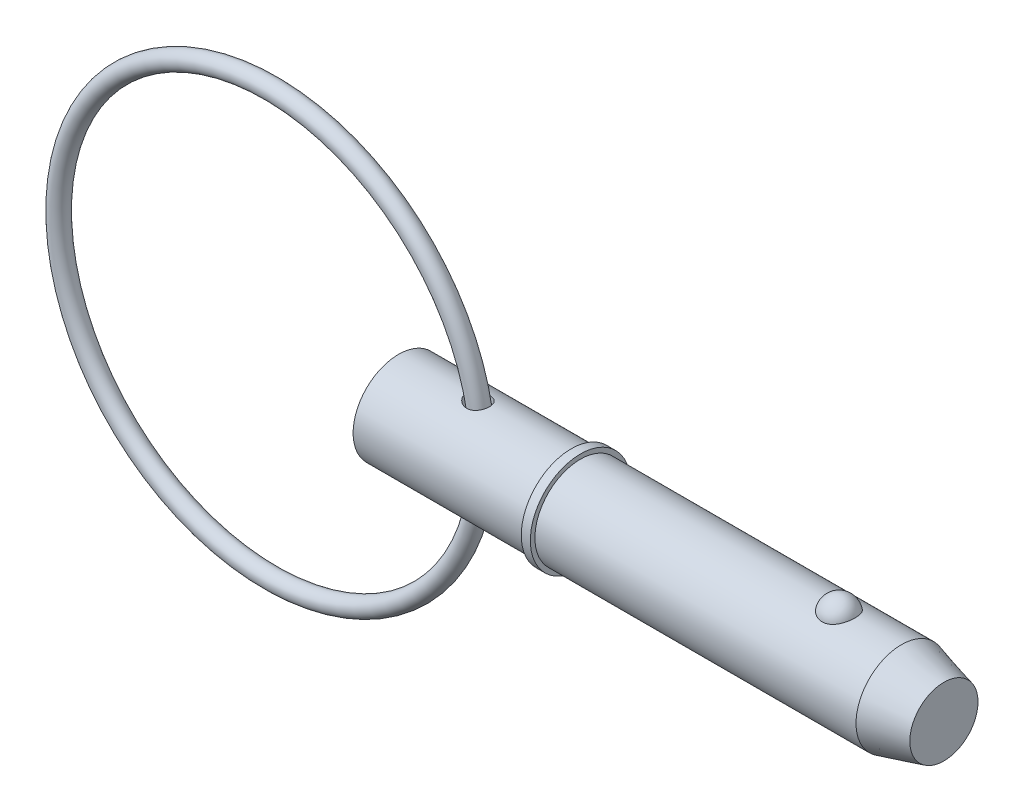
ISO-10303-21;
HEADER;
FILE_DESCRIPTION(('STEP AP214'),'2;1');
FILE_NAME('part.step','',(''),(''),'','','');
FILE_SCHEMA(('AUTOMOTIVE_DESIGN { 1 0 10303 214 1 1 1 1 }'));
ENDSEC;
DATA;
#1=APPLICATION_CONTEXT('core data for automotive mechanical design processes');
#2=APPLICATION_PROTOCOL_DEFINITION('international standard','automotive_design',2000,#1);
#3=PRODUCT_CONTEXT('',#1,'mechanical');
#4=PRODUCT('Part','Part','',(#3));
#5=PRODUCT_RELATED_PRODUCT_CATEGORY('part','',(#4));
#6=PRODUCT_DEFINITION_FORMATION('','',#4);
#7=PRODUCT_DEFINITION_CONTEXT('part definition',#1,'design');
#8=PRODUCT_DEFINITION('design','',#6,#7);
#9=PRODUCT_DEFINITION_SHAPE('','',#8);
#10=(LENGTH_UNIT() NAMED_UNIT(*) SI_UNIT(.MILLI.,.METRE.));
#11=(NAMED_UNIT(*) PLANE_ANGLE_UNIT() SI_UNIT($,.RADIAN.));
#12=(NAMED_UNIT(*) SI_UNIT($,.STERADIAN.) SOLID_ANGLE_UNIT());
#13=UNCERTAINTY_MEASURE_WITH_UNIT(LENGTH_MEASURE(1.E-05),#10,'distance_accuracy_value','');
#14=(GEOMETRIC_REPRESENTATION_CONTEXT(3) GLOBAL_UNCERTAINTY_ASSIGNED_CONTEXT((#13)) GLOBAL_UNIT_ASSIGNED_CONTEXT((#10,
#11,#12)) REPRESENTATION_CONTEXT('',''));
#15=CARTESIAN_POINT('',(0.,0.,0.));
#16=DIRECTION('',(0.,0.,1.));
#17=DIRECTION('',(1.,0.,0.));
#18=AXIS2_PLACEMENT_3D('',#15,#16,#17);
#19=CARTESIAN_POINT('',(-13.4013067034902,0.,0.));
#20=DIRECTION('',(0.,0.,1.));
#21=DIRECTION('',(1.,0.,0.));
#22=AXIS2_PLACEMENT_3D('',#19,#20,#21);
#23=TOROIDAL_SURFACE('',#22,22.225,0.952999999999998);
#24=CARTESIAN_POINT('',(9.77669329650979,0.,0.));
#25=VERTEX_POINT('',#24);
#26=VERTEX_LOOP('',#25);
#27=FACE_BOUND('',#26,.T.);
#28=ADVANCED_FACE('P0_F12',(#27),#23,.T.);
#29=CLOSED_SHELL('',(#28));
#30=MANIFOLD_SOLID_BREP('P0_B1',#29);
#31=CARTESIAN_POINT('',(0.,0.,0.));
#32=DIRECTION('',(1.,0.,0.));
#33=DIRECTION('',(0.,0.,-1.));
#34=AXIS2_PLACEMENT_3D('',#31,#32,#33);
#35=CYLINDRICAL_SURFACE('',#34,4.765);
#36=CARTESIAN_POINT('',(7.31773584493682,4.71580709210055,-0.682926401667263));
#37=CARTESIAN_POINT('',(7.3607471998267,4.70750812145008,-0.740230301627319));
#38=CARTESIAN_POINT('',(7.40883112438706,4.69869300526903,-0.79371122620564));
#39=CARTESIAN_POINT('',(7.51340999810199,4.68106981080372,-0.89180043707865));
#40=CARTESIAN_POINT('',(7.56991882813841,4.67226176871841,-0.936393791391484));
#41=CARTESIAN_POINT('',(7.689548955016,4.65568581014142,-1.01560363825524));
#42=CARTESIAN_POINT('',(7.75265928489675,4.64791621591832,-1.05023633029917));
#43=CARTESIAN_POINT('',(7.88387110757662,4.6343185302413,-1.10870278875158));
#44=CARTESIAN_POINT('',(7.95197058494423,4.62848966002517,-1.13254088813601));
#45=CARTESIAN_POINT('',(8.09209413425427,4.6194749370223,-1.16877415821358));
#46=CARTESIAN_POINT('',(8.16415141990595,4.6163169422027,-1.18104886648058));
#47=CARTESIAN_POINT('',(8.30937958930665,4.61324608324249,-1.19299123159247));
#48=CARTESIAN_POINT('',(8.38255011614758,4.61333220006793,-1.19266284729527));
#49=CARTESIAN_POINT('',(8.52374186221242,4.61674026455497,-1.17939593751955));
#50=CARTESIAN_POINT('',(8.59183022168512,4.61989017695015,-1.16712781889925));
#51=CARTESIAN_POINT('',(8.72470143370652,4.62884731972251,-1.13107903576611));
#52=CARTESIAN_POINT('',(8.78948513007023,4.63465386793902,-1.10730132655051));
#53=CARTESIAN_POINT('',(8.91088768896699,4.64792402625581,-1.05016249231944));
#54=CARTESIAN_POINT('',(8.96774302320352,4.65530108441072,-1.01728198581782));
#55=CARTESIAN_POINT('',(9.07499804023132,4.67102002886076,-0.942471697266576));
#56=CARTESIAN_POINT('',(9.12539777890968,4.6793619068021,-0.900541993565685));
#57=CARTESIAN_POINT('',(9.21836221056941,4.69607497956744,-0.808868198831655));
#58=CARTESIAN_POINT('',(9.26093651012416,4.70444612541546,-0.759133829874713));
#59=CARTESIAN_POINT('',(9.33728390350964,4.72032100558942,-0.653192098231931));
#60=CARTESIAN_POINT('',(9.3710564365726,4.72782468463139,-0.596984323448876));
#61=CARTESIAN_POINT('',(9.42940600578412,4.74126034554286,-0.478808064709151));
#62=CARTESIAN_POINT('',(9.45384681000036,4.74716869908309,-0.416769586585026));
#63=CARTESIAN_POINT('',(9.49226260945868,4.75663465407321,-0.289362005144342));
#64=CARTESIAN_POINT('',(9.50623742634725,4.76019221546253,-0.22399284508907));
#65=CARTESIAN_POINT('',(9.52342004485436,4.76458450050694,-0.0914886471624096));
#66=CARTESIAN_POINT('',(9.52658321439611,4.7654079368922,-0.0243474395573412));
#67=CARTESIAN_POINT('',(9.52194012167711,4.76421136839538,0.109528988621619));
#68=CARTESIAN_POINT('',(9.51413380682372,4.7621913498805,0.176264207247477));
#69=CARTESIAN_POINT('',(9.48775485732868,4.75552896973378,0.307367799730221));
#70=CARTESIAN_POINT('',(9.4691926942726,4.75088915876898,0.371738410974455));
#71=CARTESIAN_POINT('',(9.42175836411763,4.73949008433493,0.496364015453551));
#72=CARTESIAN_POINT('',(9.39288586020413,4.73273075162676,0.556618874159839));
#73=CARTESIAN_POINT('',(9.32549385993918,4.71782154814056,0.671371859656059));
#74=CARTESIAN_POINT('',(9.28696367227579,4.70967013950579,0.725863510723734));
#75=CARTESIAN_POINT('',(9.20123305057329,4.6928883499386,0.827453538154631));
#76=CARTESIAN_POINT('',(9.15403300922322,4.68425799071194,0.874552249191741));
#77=CARTESIAN_POINT('',(9.05250467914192,4.66754854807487,0.959736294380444));
#78=CARTESIAN_POINT('',(8.99822095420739,4.65946646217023,0.997874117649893));
#79=CARTESIAN_POINT('',(8.88381123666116,4.64472049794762,1.06440739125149));
#80=CARTESIAN_POINT('',(8.82368614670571,4.63805640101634,1.09280434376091));
#81=CARTESIAN_POINT('',(8.70022952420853,4.62698068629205,1.13878427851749));
#82=CARTESIAN_POINT('',(8.63695594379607,4.62253830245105,1.15651569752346));
#83=CARTESIAN_POINT('',(8.50825296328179,4.61622454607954,1.18146656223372));
#84=CARTESIAN_POINT('',(8.44282353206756,4.61435321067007,1.18868585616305));
#85=CARTESIAN_POINT('',(8.31119087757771,4.61332122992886,1.19268442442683));
#86=CARTESIAN_POINT('',(8.24498542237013,4.61417920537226,1.18939198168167));
#87=CARTESIAN_POINT('',(8.11397487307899,4.61847671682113,1.17259121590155));
#88=CARTESIAN_POINT('',(8.04917011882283,4.62191687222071,1.15908044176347));
#89=CARTESIAN_POINT('',(7.91946226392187,4.63117528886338,1.12153047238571));
#90=CARTESIAN_POINT('',(7.85470460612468,4.6371000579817,1.09701575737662));
#91=CARTESIAN_POINT('',(7.7300035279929,4.65063246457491,1.03814807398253));
#92=CARTESIAN_POINT('',(7.67006197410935,4.65824075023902,1.00379131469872));
#93=CARTESIAN_POINT('',(7.55352765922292,4.67473656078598,0.924015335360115));
#94=CARTESIAN_POINT('',(7.49726947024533,4.68366994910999,0.878115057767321));
#95=CARTESIAN_POINT('',(7.39344083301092,4.70144936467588,0.777311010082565));
#96=CARTESIAN_POINT('',(7.34587087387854,4.71029538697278,0.722406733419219));
#97=CARTESIAN_POINT('',(7.26188955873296,4.72669773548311,0.605773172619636));
#98=CARTESIAN_POINT('',(7.22531316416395,4.73427229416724,0.544165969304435));
#99=CARTESIAN_POINT('',(7.16406269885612,4.74732663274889,0.415095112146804));
#100=CARTESIAN_POINT('',(7.13937848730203,4.75280819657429,0.347636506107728));
#101=CARTESIAN_POINT('',(7.10494917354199,4.7605495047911,0.215359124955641));
#102=CARTESIAN_POINT('',(7.09405441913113,4.76305589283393,0.150853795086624));
#103=CARTESIAN_POINT('',(7.08387189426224,4.76539656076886,0.0208839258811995));
#104=CARTESIAN_POINT('',(7.0845805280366,4.76523166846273,-0.0445803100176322));
#105=CARTESIAN_POINT('',(7.09709111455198,4.76236014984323,-0.169693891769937));
#106=CARTESIAN_POINT('',(7.10810913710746,4.75983315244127,-0.229428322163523));
#107=CARTESIAN_POINT('',(7.13959099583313,4.75276726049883,-0.346187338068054));
#108=CARTESIAN_POINT('',(7.16004881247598,4.7482296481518,-0.403213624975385));
#109=CARTESIAN_POINT('',(7.20270325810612,4.73907067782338,-0.498040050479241));
#110=CARTESIAN_POINT('',(7.22286864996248,4.73481668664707,-0.536809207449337));
#111=CARTESIAN_POINT('',(7.26730952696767,4.72570777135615,-0.611832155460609));
#112=CARTESIAN_POINT('',(7.29158512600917,4.72085283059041,-0.64808587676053));
#113=CARTESIAN_POINT('',(7.31773584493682,4.71580709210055,-0.682926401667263));
#114=B_SPLINE_CURVE_WITH_KNOTS('',3,(#36,#37,#38,#39,#40,#41,#42,#43,#44,#45,#46,#47,#48,#49,
#50,#51,#52,#53,#54,#55,#56,#57,#58,#59,#60,#61,#62,#63,#64,#65,#66,#67,#68,#69,#70,#71,#72,#73,
#74,#75,#76,#77,#78,#79,#80,#81,#82,#83,#84,#85,#86,#87,#88,#89,#90,#91,#92,#93,#94,#95,#96,#97,
#98,#99,#100,#101,#102,#103,#104,#105,#106,#107,#108,#109,#110,#111,#112,#113),.UNSPECIFIED.,
.T.,.F.,(4,2,2,2,2,2,2,2,2,2,2,2,2,2,2,2,2,2,2,2,2,2,2,2,2,2,2,2,2,2,2,2,2,2,2,2,2,2,4),(0.,
0.216219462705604,0.432799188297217,0.649024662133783,0.865163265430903,1.08352938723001,
1.30182691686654,1.50853487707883,1.71518978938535,1.91252381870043,2.1098561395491,
2.30694457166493,2.50404555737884,2.70392296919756,2.90380378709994,3.10450875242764,
3.30521468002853,3.5057255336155,3.70624293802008,3.90698330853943,4.10771458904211,
4.30723900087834,4.50673262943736,4.70338139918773,4.90003300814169,5.09802914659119,
5.29607279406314,5.5036500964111,5.7113074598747,5.92972727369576,6.14815938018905,
6.36312650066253,6.57790998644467,6.77325899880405,6.96854747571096,7.15009726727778,
7.33153144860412,7.46298830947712,7.59444881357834),.UNSPECIFIED.);
#115=CARTESIAN_POINT('',(7.31773584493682,4.71580709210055,-0.682926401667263));
#116=VERTEX_POINT('',#115);
#117=EDGE_CURVE('P1_E42',#116,#116,#114,.T.);
#118=ORIENTED_EDGE('',*,*,#117,.T.);
#119=EDGE_LOOP('',(#118));
#120=FACE_BOUND('',#119,.T.);
#121=CARTESIAN_POINT('',(0.,0.,0.));
#122=DIRECTION('',(1.,0.,0.));
#123=DIRECTION('',(0.,0.,-1.));
#124=AXIS2_PLACEMENT_3D('',#121,#122,#123);
#125=CIRCLE('',#124,4.765);
#126=CARTESIAN_POINT('',(0.,0.,-4.765));
#127=VERTEX_POINT('',#126);
#128=EDGE_CURVE('P1_E9',#127,#127,#125,.T.);
#129=ORIENTED_EDGE('',*,*,#128,.T.);
#130=EDGE_LOOP('',(#129));
#131=FACE_BOUND('',#130,.T.);
#132=CARTESIAN_POINT('',(18.097,0.,0.));
#133=DIRECTION('',(1.,0.,0.));
#134=DIRECTION('',(0.,0.,-1.));
#135=AXIS2_PLACEMENT_3D('',#132,#133,#134);
#136=CIRCLE('',#135,4.765);
#137=CARTESIAN_POINT('',(18.097,0.,-4.765));
#138=VERTEX_POINT('',#137);
#139=EDGE_CURVE('P1_E25',#138,#138,#136,.T.);
#140=ORIENTED_EDGE('',*,*,#139,.F.);
#141=EDGE_LOOP('',(#140));
#142=FACE_BOUND('',#141,.T.);
#143=CARTESIAN_POINT('',(7.31773584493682,-4.71580709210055,-0.682926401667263));
#144=CARTESIAN_POINT('',(7.27956054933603,-4.72317282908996,-0.63206220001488));
#145=CARTESIAN_POINT('',(7.24535712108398,-4.7301361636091,-0.578155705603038));
#146=CARTESIAN_POINT('',(7.18611785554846,-4.74256090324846,-0.465352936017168));
#147=CARTESIAN_POINT('',(7.16107836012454,-4.74802290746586,-0.406458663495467));
#148=CARTESIAN_POINT('',(7.12119149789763,-4.75686558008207,-0.284913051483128));
#149=CARTESIAN_POINT('',(7.1063796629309,-4.76023898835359,-0.222249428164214));
#150=CARTESIAN_POINT('',(7.08786546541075,-4.76447177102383,-0.0952170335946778));
#151=CARTESIAN_POINT('',(7.08416018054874,-4.76533180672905,-0.0308487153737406));
#152=CARTESIAN_POINT('',(7.08795686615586,-4.76445764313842,0.0942755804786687));
#153=CARTESIAN_POINT('',(7.09490366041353,-4.762851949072,0.155050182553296));
#154=CARTESIAN_POINT('',(7.11863973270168,-4.75746086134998,0.2745356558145));
#155=CARTESIAN_POINT('',(7.13542953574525,-4.75367535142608,0.333246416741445));
#156=CARTESIAN_POINT('',(7.17817193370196,-4.74430545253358,0.447305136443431));
#157=CARTESIAN_POINT('',(7.20415836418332,-4.73871442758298,0.502639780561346));
#158=CARTESIAN_POINT('',(7.26428068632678,-4.72628508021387,0.608523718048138));
#159=CARTESIAN_POINT('',(7.29841897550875,-4.71944639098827,0.659071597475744));
#160=CARTESIAN_POINT('',(7.37680984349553,-4.70456239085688,0.758311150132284));
#161=CARTESIAN_POINT('',(7.42165519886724,-4.69646426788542,0.806526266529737));
#162=CARTESIAN_POINT('',(7.51828933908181,-4.68032890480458,0.895428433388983));
#163=CARTESIAN_POINT('',(7.57008134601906,-4.67229169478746,0.936111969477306));
#164=CARTESIAN_POINT('',(7.68397204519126,-4.65640659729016,1.01229731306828));
#165=CARTESIAN_POINT('',(7.74657226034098,-4.64863251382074,1.04706751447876));
#166=CARTESIAN_POINT('',(7.87680110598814,-4.6349740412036,1.10596507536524));
#167=CARTESIAN_POINT('',(7.94443054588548,-4.62908995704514,1.13009071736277));
#168=CARTESIAN_POINT('',(8.08402017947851,-4.61989019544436,1.16713943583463));
#169=CARTESIAN_POINT('',(8.15603143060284,-4.61661596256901,1.17988211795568));
#170=CARTESIAN_POINT('',(8.30124697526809,-4.61330446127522,1.1927680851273));
#171=CARTESIAN_POINT('',(8.37445077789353,-4.61326589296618,1.19291642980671));
#172=CARTESIAN_POINT('',(8.51584800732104,-4.61644036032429,1.18056687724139));
#173=CARTESIAN_POINT('',(8.58410302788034,-4.61948317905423,1.16873099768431));
#174=CARTESIAN_POINT('',(8.71738052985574,-4.6282520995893,1.13350536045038));
#175=CARTESIAN_POINT('',(8.78240382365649,-4.63397752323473,1.11011852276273));
#176=CARTESIAN_POINT('',(8.90428519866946,-4.64711877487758,1.05371003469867));
#177=CARTESIAN_POINT('',(8.96138096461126,-4.6544450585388,1.02117932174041));
#178=CARTESIAN_POINT('',(9.06916653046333,-4.6700970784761,0.947021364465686));
#179=CARTESIAN_POINT('',(9.11985639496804,-4.67842280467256,0.905394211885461));
#180=CARTESIAN_POINT('',(9.2134071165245,-4.69513303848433,0.814300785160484));
#181=CARTESIAN_POINT('',(9.25628268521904,-4.70351740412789,0.764849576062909));
#182=CARTESIAN_POINT('',(9.33327173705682,-4.71945185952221,0.659422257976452));
#183=CARTESIAN_POINT('',(9.3673846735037,-4.72700189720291,0.603445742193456));
#184=CARTESIAN_POINT('',(9.42645214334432,-4.74055953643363,0.485673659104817));
#185=CARTESIAN_POINT('',(9.45127042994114,-4.74654383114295,0.423807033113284));
#186=CARTESIAN_POINT('',(9.49046298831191,-4.756182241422,0.296676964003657));
#187=CARTESIAN_POINT('',(9.50483706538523,-4.75983631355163,0.231413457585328));
#188=CARTESIAN_POINT('',(9.52283408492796,-4.76443282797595,0.0990368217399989));
#189=CARTESIAN_POINT('',(9.52641016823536,-4.76536345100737,0.0319169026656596));
#190=CARTESIAN_POINT('',(9.52259067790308,-4.76437893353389,-0.101988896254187));
#191=CARTESIAN_POINT('',(9.5151950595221,-4.76246378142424,-0.168774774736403));
#192=CARTESIAN_POINT('',(9.48962516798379,-4.75599746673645,-0.300048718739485));
#193=CARTESIAN_POINT('',(9.4714615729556,-4.75144891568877,-0.364538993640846));
#194=CARTESIAN_POINT('',(9.42480303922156,-4.74020887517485,-0.489470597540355));
#195=CARTESIAN_POINT('',(9.396307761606,-4.73351731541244,-0.549911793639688));
#196=CARTESIAN_POINT('',(9.32963953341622,-4.71871240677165,-0.665099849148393));
#197=CARTESIAN_POINT('',(9.29145577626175,-4.71059747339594,-0.719840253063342));
#198=CARTESIAN_POINT('',(9.20637695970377,-4.69385254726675,-0.82198328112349));
#199=CARTESIAN_POINT('',(9.15948227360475,-4.68522257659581,-0.869386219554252));
#200=CARTESIAN_POINT('',(9.05849937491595,-4.66847516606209,-0.955233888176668));
#201=CARTESIAN_POINT('',(9.00445430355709,-4.6603550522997,-0.993728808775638));
#202=CARTESIAN_POINT('',(8.8904576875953,-4.64550122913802,-1.06100691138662));
#203=CARTESIAN_POINT('',(8.83050704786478,-4.63876730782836,-1.08979157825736));
#204=CARTESIAN_POINT('',(8.70732873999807,-4.6275305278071,-1.13655620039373));
#205=CARTESIAN_POINT('',(8.64416019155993,-4.62299714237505,-1.15468477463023));
#206=CARTESIAN_POINT('',(8.51559711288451,-4.61649071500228,-1.18043067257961));
#207=CARTESIAN_POINT('',(8.4502025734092,-4.61451768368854,-1.18804795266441));
#208=CARTESIAN_POINT('',(8.31862013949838,-4.61328355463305,-1.19283094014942));
#209=CARTESIAN_POINT('',(8.25242983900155,-4.61403911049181,-1.18993246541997));
#210=CARTESIAN_POINT('',(8.12138461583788,-4.61814057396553,-1.17391149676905));
#211=CARTESIAN_POINT('',(8.0565300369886,-4.62148714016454,-1.16078640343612));
#212=CARTESIAN_POINT('',(7.92669960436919,-4.63056912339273,-1.12402333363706));
#213=CARTESIAN_POINT('',(7.86186447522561,-4.63641051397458,-1.09991536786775));
#214=CARTESIAN_POINT('',(7.73694230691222,-4.64980121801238,-1.04185298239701));
#215=CARTESIAN_POINT('',(7.6768568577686,-4.65735110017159,-1.0078952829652));
#216=CARTESIAN_POINT('',(7.56207884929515,-4.67346080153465,-0.930364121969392));
#217=CARTESIAN_POINT('',(7.5074784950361,-4.68203382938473,-0.886656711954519));
#218=CARTESIAN_POINT('',(7.40624045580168,-4.69916824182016,-0.79082583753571));
#219=CARTESIAN_POINT('',(7.35959988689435,-4.7077296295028,-0.738705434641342));
#220=CARTESIAN_POINT('',(7.31773584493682,-4.71580709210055,-0.682926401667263));
#221=B_SPLINE_CURVE_WITH_KNOTS('',3,(#143,#144,#145,#146,#147,#148,#149,#150,#151,#152,#153,
#154,#155,#156,#157,#158,#159,#160,#161,#162,#163,#164,#165,#166,#167,#168,#169,#170,#171,#172,
#173,#174,#175,#176,#177,#178,#179,#180,#181,#182,#183,#184,#185,#186,#187,#188,#189,#190,#191,
#192,#193,#194,#195,#196,#197,#198,#199,#200,#201,#202,#203,#204,#205,#206,#207,#208,#209,#210,
#211,#212,#213,#214,#215,#216,#217,#218,#219,#220),.UNSPECIFIED.,.T.,.F.,(4,2,2,2,2,2,2,2,2,2,2,
2,2,2,2,2,2,2,2,2,2,2,2,2,2,2,2,2,2,2,2,2,2,2,2,2,2,2,4),(0.,0.191851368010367,0.38362606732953,
0.576063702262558,0.768450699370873,0.951145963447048,1.13385097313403,1.31723528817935,
1.50067360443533,1.69887079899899,1.8971602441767,2.11225870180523,2.32739185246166,
2.54587681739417,2.76427400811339,2.97123130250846,3.17813630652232,3.37555441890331,
3.57297054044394,3.77001106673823,3.96706388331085,4.16690159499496,4.36674303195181,
4.56745046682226,4.76815872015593,4.96866827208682,5.16918440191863,5.36992517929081,
5.5706573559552,5.77022940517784,5.96977092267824,6.16645904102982,6.36314797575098,
6.56103940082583,6.75898114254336,6.96633026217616,7.17374850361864,7.384214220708,
7.59460352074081),.UNSPECIFIED.);
#222=CARTESIAN_POINT('',(7.31773584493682,-4.71580709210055,-0.682926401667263));
#223=VERTEX_POINT('',#222);
#224=EDGE_CURVE('P1_E17',#223,#223,#221,.T.);
#225=ORIENTED_EDGE('',*,*,#224,.T.);
#226=EDGE_LOOP('',(#225));
#227=FACE_BOUND('',#226,.T.);
#228=ADVANCED_FACE('P1_F13',(#120,#131,#142,#227),#35,.T.);
#229=CARTESIAN_POINT('',(0.,0.,0.));
#230=DIRECTION('',(1.,0.,0.));
#231=DIRECTION('',(0.,0.,-1.));
#232=AXIS2_PLACEMENT_3D('',#229,#230,#231);
#233=CYLINDRICAL_SURFACE('',#232,4.765);
#234=CARTESIAN_POINT('',(52.7041944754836,0.,0.));
#235=DIRECTION('',(1.,0.,0.));
#236=DIRECTION('',(0.,0.,-1.));
#237=AXIS2_PLACEMENT_3D('',#234,#235,#236);
#238=CIRCLE('',#237,4.765);
#239=CARTESIAN_POINT('',(52.7041944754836,0.,-4.765));
#240=VERTEX_POINT('',#239);
#241=EDGE_CURVE('P1_E99',#240,#240,#238,.T.);
#242=ORIENTED_EDGE('',*,*,#241,.F.);
#243=EDGE_LOOP('',(#242));
#244=FACE_BOUND('',#243,.T.);
#245=CARTESIAN_POINT('',(19.05,0.,0.));
#246=DIRECTION('',(1.,0.,0.));
#247=DIRECTION('',(0.,0.,-1.));
#248=AXIS2_PLACEMENT_3D('',#245,#246,#247);
#249=CIRCLE('',#248,4.765);
#250=CARTESIAN_POINT('',(19.05,0.,-4.765));
#251=VERTEX_POINT('',#250);
#252=EDGE_CURVE('P1_E96',#251,#251,#249,.T.);
#253=ORIENTED_EDGE('',*,*,#252,.T.);
#254=EDGE_LOOP('',(#253));
#255=FACE_BOUND('',#254,.T.);
#256=CARTESIAN_POINT('',(46.151020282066,4.42764777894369,1.76101111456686));
#257=CARTESIAN_POINT('',(46.0597212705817,4.42764470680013,1.76101422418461));
#258=CARTESIAN_POINT('',(45.9684468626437,4.4305909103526,1.75366340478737));
#259=CARTESIAN_POINT('',(45.7886154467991,4.44201846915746,1.72451180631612));
#260=CARTESIAN_POINT('',(45.7000577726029,4.45049845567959,1.702714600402));
#261=CARTESIAN_POINT('',(45.5282570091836,4.47200516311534,1.64539370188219));
#262=CARTESIAN_POINT('',(45.4450064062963,4.48502527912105,1.60988994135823));
#263=CARTESIAN_POINT('',(45.2857633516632,4.51419542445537,1.52617873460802));
#264=CARTESIAN_POINT('',(45.2097723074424,4.53034605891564,1.47796883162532));
#265=CARTESIAN_POINT('',(45.0647445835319,4.5645931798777,1.36860494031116));
#266=CARTESIAN_POINT('',(44.9959645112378,4.58273170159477,1.30712420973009));
#267=CARTESIAN_POINT('',(44.8693423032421,4.61870302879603,1.1737020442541));
#268=CARTESIAN_POINT('',(44.8115021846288,4.63653577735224,1.1017586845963));
#269=CARTESIAN_POINT('',(44.7055709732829,4.67090140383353,0.945806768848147));
#270=CARTESIAN_POINT('',(44.6580305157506,4.68734068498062,0.861402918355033));
#271=CARTESIAN_POINT('',(44.5770817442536,4.71628466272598,0.685442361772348));
#272=CARTESIAN_POINT('',(44.5436747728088,4.72878898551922,0.593884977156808));
#273=CARTESIAN_POINT('',(44.491287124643,4.74874061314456,0.40478128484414));
#274=CARTESIAN_POINT('',(44.4725178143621,4.75611366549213,0.307168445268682));
#275=CARTESIAN_POINT('',(44.4505846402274,4.76475393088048,0.109940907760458));
#276=CARTESIAN_POINT('',(44.4474205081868,4.76602124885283,0.0103262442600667));
#277=CARTESIAN_POINT('',(44.4567405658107,4.76232928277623,-0.187629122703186));
#278=CARTESIAN_POINT('',(44.4691588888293,4.7573962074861,-0.28597342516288));
#279=CARTESIAN_POINT('',(44.5092804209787,4.74184975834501,-0.479027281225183));
#280=CARTESIAN_POINT('',(44.5369839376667,4.7312362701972,-0.573736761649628));
#281=CARTESIAN_POINT('',(44.6071581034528,4.70540026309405,-0.756973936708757));
#282=CARTESIAN_POINT('',(44.6496460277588,4.69017235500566,-0.845494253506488));
#283=CARTESIAN_POINT('',(44.748520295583,4.6566986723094,-1.01378033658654));
#284=CARTESIAN_POINT('',(44.8049076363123,4.63845268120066,-1.09354547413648));
#285=CARTESIAN_POINT('',(44.930552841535,4.60085438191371,-1.24228523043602));
#286=CARTESIAN_POINT('',(44.9998439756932,4.58149930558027,-1.31123108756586));
#287=CARTESIAN_POINT('',(45.1496066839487,4.54391653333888,-1.43607409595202));
#288=CARTESIAN_POINT('',(45.2300771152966,4.52568872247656,-1.49197257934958));
#289=CARTESIAN_POINT('',(45.3981500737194,4.49293007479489,-1.58786764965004));
#290=CARTESIAN_POINT('',(45.4855445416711,4.47832346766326,-1.62820219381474));
#291=CARTESIAN_POINT('',(45.666553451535,4.45406011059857,-1.69345757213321));
#292=CARTESIAN_POINT('',(45.7601655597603,4.44440151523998,-1.71838415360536));
#293=CARTESIAN_POINT('',(45.9458939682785,4.43159888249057,-1.7511284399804));
#294=CARTESIAN_POINT('',(46.037849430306,4.42815213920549,-1.75974223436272));
#295=CARTESIAN_POINT('',(46.2219658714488,4.42724735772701,-1.76201865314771));
#296=CARTESIAN_POINT('',(46.3141268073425,4.42978816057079,-1.75568417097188));
#297=CARTESIAN_POINT('',(46.4931292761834,4.4403864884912,-1.72869560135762));
#298=CARTESIAN_POINT('',(46.5800474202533,4.44827555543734,-1.7084785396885));
#299=CARTESIAN_POINT('',(46.7491314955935,4.46852246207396,-1.65479562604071));
#300=CARTESIAN_POINT('',(46.8312970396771,4.4808806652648,-1.62132869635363));
#301=CARTESIAN_POINT('',(46.9905916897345,4.50907357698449,-1.54120560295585));
#302=CARTESIAN_POINT('',(47.0675700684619,4.52497884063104,-1.49427526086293));
#303=CARTESIAN_POINT('',(47.2127080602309,4.55845148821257,-1.38881222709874));
#304=CARTESIAN_POINT('',(47.2808656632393,4.57601924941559,-1.33027689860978));
#305=CARTESIAN_POINT('',(47.4100990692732,4.61196537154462,-1.19991049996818));
#306=CARTESIAN_POINT('',(47.4706562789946,4.63034074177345,-1.12756415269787));
#307=CARTESIAN_POINT('',(47.5792797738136,4.66513959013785,-0.97361299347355));
#308=CARTESIAN_POINT('',(47.6273438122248,4.68156271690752,-0.892006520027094));
#309=CARTESIAN_POINT('',(47.711383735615,4.71130224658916,-0.71889227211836));
#310=CARTESIAN_POINT('',(47.7469185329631,4.724501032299,-0.627149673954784));
#311=CARTESIAN_POINT('',(47.8029522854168,4.74571823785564,-0.438611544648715));
#312=CARTESIAN_POINT('',(47.823450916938,4.75373654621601,-0.34181590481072));
#313=CARTESIAN_POINT('',(47.8490338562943,4.76378905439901,-0.145633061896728));
#314=CARTESIAN_POINT('',(47.854076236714,4.76580697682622,-0.0462395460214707));
#315=CARTESIAN_POINT('',(47.8485239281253,4.7636057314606,0.152038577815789));
#316=CARTESIAN_POINT('',(47.8379294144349,4.75938663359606,0.250923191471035));
#317=CARTESIAN_POINT('',(47.8013875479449,4.74516937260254,0.445004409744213));
#318=CARTESIAN_POINT('',(47.7754964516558,4.73519238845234,0.540213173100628));
#319=CARTESIAN_POINT('',(47.7089273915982,4.71049394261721,0.724662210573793));
#320=CARTESIAN_POINT('',(47.6682485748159,4.69577220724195,0.813902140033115));
#321=CARTESIAN_POINT('',(47.5727177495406,4.66303767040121,0.984313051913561));
#322=CARTESIAN_POINT('',(47.5178042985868,4.64501070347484,1.06544688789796));
#323=CARTESIAN_POINT('',(47.3950496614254,4.60764678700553,1.21692673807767));
#324=CARTESIAN_POINT('',(47.3272086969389,4.58830985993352,1.28727293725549));
#325=CARTESIAN_POINT('',(47.1805480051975,4.55060370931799,1.41479271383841));
#326=CARTESIAN_POINT('',(47.1017918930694,4.53222967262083,1.4720378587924));
#327=CARTESIAN_POINT('',(46.9349890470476,4.49849576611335,1.57212016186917));
#328=CARTESIAN_POINT('',(46.8469417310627,4.48313608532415,1.6149564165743));
#329=CARTESIAN_POINT('',(46.6597918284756,4.45676184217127,1.68642657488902));
#330=CARTESIAN_POINT('',(46.5603653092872,4.44598302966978,1.71430590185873));
#331=CARTESIAN_POINT('',(46.3576210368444,4.43142918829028,1.75159258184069));
#332=CARTESIAN_POINT('',(46.2543049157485,4.42765125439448,1.76100759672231));
#333=CARTESIAN_POINT('',(46.151020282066,4.42764777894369,1.76101111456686));
#334=B_SPLINE_CURVE_WITH_KNOTS('',3,(#256,#257,#258,#259,#260,#261,#262,#263,#264,#265,#266,
#267,#268,#269,#270,#271,#272,#273,#274,#275,#276,#277,#278,#279,#280,#281,#282,#283,#284,#285,
#286,#287,#288,#289,#290,#291,#292,#293,#294,#295,#296,#297,#298,#299,#300,#301,#302,#303,#304,
#305,#306,#307,#308,#309,#310,#311,#312,#313,#314,#315,#316,#317,#318,#319,#320,#321,#322,#323,
#324,#325,#326,#327,#328,#329,#330,#331,#332,#333),.UNSPECIFIED.,.T.,.F.,(4,2,2,2,2,2,2,2,2,2,2,
2,2,2,2,2,2,2,2,2,2,2,2,2,2,2,2,2,2,2,2,2,2,2,2,2,2,2,4),(0.,0.273517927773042,
0.546968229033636,0.820022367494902,1.09312934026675,1.37393946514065,1.6548013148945,
1.94820420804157,2.24163496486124,2.53922817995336,2.83681628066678,3.13315071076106,
3.42949110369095,3.72617893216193,4.02288805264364,4.32037303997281,4.61782764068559,
4.90840095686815,5.19886582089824,5.47474855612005,5.75057789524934,6.01809977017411,
6.28564340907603,6.55907787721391,6.83257454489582,7.1196298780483,7.40673679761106,
7.70312663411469,7.99952284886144,8.29672237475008,8.59391856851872,8.890028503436,
9.18615552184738,9.48358266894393,9.78100471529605,10.0767610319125,10.3725358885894,
10.6820893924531,10.9915144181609),.UNSPECIFIED.);
#335=CARTESIAN_POINT('',(46.151020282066,4.42764777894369,1.76101111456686));
#336=VERTEX_POINT('',#335);
#337=EDGE_CURVE('P1_E34',#336,#336,#334,.T.);
#338=ORIENTED_EDGE('',*,*,#337,.T.);
#339=EDGE_LOOP('',(#338));
#340=FACE_BOUND('',#339,.T.);
#341=ADVANCED_FACE('P1_F46',(#244,#255,#340),#233,.T.);
#342=CARTESIAN_POINT('',(0.,0.,0.));
#343=DIRECTION('',(-1.,0.,0.));
#344=DIRECTION('',(0.,0.,1.));
#345=AXIS2_PLACEMENT_3D('',#342,#343,#344);
#346=PLANE('',#345);
#347=ORIENTED_EDGE('',*,*,#128,.F.);
#348=EDGE_LOOP('',(#347));
#349=FACE_BOUND('',#348,.T.);
#350=ADVANCED_FACE('P1_F15',(#349),#346,.T.);
#351=CARTESIAN_POINT('',(18.097,4.765,0.));
#352=DIRECTION('',(-1.,0.,0.));
#353=DIRECTION('',(0.,0.,1.));
#354=AXIS2_PLACEMENT_3D('',#351,#352,#353);
#355=PLANE('',#354);
#356=ORIENTED_EDGE('',*,*,#139,.T.);
#357=EDGE_LOOP('',(#356));
#358=FACE_BOUND('',#357,.T.);
#359=CARTESIAN_POINT('',(18.097,0.,0.));
#360=DIRECTION('',(1.,0.,0.));
#361=DIRECTION('',(0.,0.,-1.));
#362=AXIS2_PLACEMENT_3D('',#359,#360,#361);
#363=CIRCLE('',#362,5.2415);
#364=CARTESIAN_POINT('',(18.097,0.,-5.2415));
#365=VERTEX_POINT('',#364);
#366=EDGE_CURVE('P1_E30',#365,#365,#363,.T.);
#367=ORIENTED_EDGE('',*,*,#366,.F.);
#368=EDGE_LOOP('',(#367));
#369=FACE_BOUND('',#368,.T.);
#370=ADVANCED_FACE('P1_F81',(#358,#369),#355,.T.);
#371=CARTESIAN_POINT('',(0.,0.,0.));
#372=DIRECTION('',(1.,0.,0.));
#373=DIRECTION('',(0.,0.,-1.));
#374=AXIS2_PLACEMENT_3D('',#371,#372,#373);
#375=CYLINDRICAL_SURFACE('',#374,5.2415);
#376=ORIENTED_EDGE('',*,*,#366,.T.);
#377=EDGE_LOOP('',(#376));
#378=FACE_BOUND('',#377,.T.);
#379=CARTESIAN_POINT('',(19.05,0.,0.));
#380=DIRECTION('',(1.,0.,0.));
#381=DIRECTION('',(0.,0.,-1.));
#382=AXIS2_PLACEMENT_3D('',#379,#380,#381);
#383=CIRCLE('',#382,5.2415);
#384=CARTESIAN_POINT('',(19.05,0.,-5.2415));
#385=VERTEX_POINT('',#384);
#386=EDGE_CURVE('P1_E95',#385,#385,#383,.T.);
#387=ORIENTED_EDGE('',*,*,#386,.F.);
#388=EDGE_LOOP('',(#387));
#389=FACE_BOUND('',#388,.T.);
#390=ADVANCED_FACE('P1_F68',(#378,#389),#375,.T.);
#391=CARTESIAN_POINT('',(19.05,5.2415,0.));
#392=DIRECTION('',(1.,0.,0.));
#393=DIRECTION('',(0.,0.,-1.));
#394=AXIS2_PLACEMENT_3D('',#391,#392,#393);
#395=PLANE('',#394);
#396=ORIENTED_EDGE('',*,*,#386,.T.);
#397=EDGE_LOOP('',(#396));
#398=FACE_BOUND('',#397,.T.);
#399=ORIENTED_EDGE('',*,*,#252,.F.);
#400=EDGE_LOOP('',(#399));
#401=FACE_BOUND('',#400,.T.);
#402=ADVANCED_FACE('P1_F62',(#398,#401),#395,.T.);
#403=CARTESIAN_POINT('',(57.15,0.,0.));
#404=DIRECTION('',(-1.,0.,0.));
#405=DIRECTION('',(0.,0.,1.));
#406=AXIS2_PLACEMENT_3D('',#403,#404,#405);
#407=CONICAL_SURFACE('',#406,3.57375000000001,0.26179938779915);
#408=ORIENTED_EDGE('',*,*,#241,.T.);
#409=EDGE_LOOP('',(#408));
#410=FACE_BOUND('',#409,.T.);
#411=CARTESIAN_POINT('',(57.15,0.,0.));
#412=DIRECTION('',(1.,0.,0.));
#413=DIRECTION('',(0.,0.,-1.));
#414=AXIS2_PLACEMENT_3D('',#411,#412,#413);
#415=CIRCLE('',#414,3.57375000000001);
#416=CARTESIAN_POINT('',(57.15,0.,-3.57375000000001));
#417=VERTEX_POINT('',#416);
#418=EDGE_CURVE('P1_E41',#417,#417,#415,.T.);
#419=ORIENTED_EDGE('',*,*,#418,.F.);
#420=EDGE_LOOP('',(#419));
#421=FACE_BOUND('',#420,.T.);
#422=ADVANCED_FACE('P1_F59',(#410,#421),#407,.T.);
#423=CARTESIAN_POINT('',(57.15,3.57375000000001,0.));
#424=DIRECTION('',(1.,0.,0.));
#425=DIRECTION('',(0.,0.,-1.));
#426=AXIS2_PLACEMENT_3D('',#423,#424,#425);
#427=PLANE('',#426);
#428=ORIENTED_EDGE('',*,*,#418,.T.);
#429=EDGE_LOOP('',(#428));
#430=FACE_BOUND('',#429,.T.);
#431=ADVANCED_FACE('P1_F55',(#430),#427,.T.);
#432=CARTESIAN_POINT('',(46.151020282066,4.2885,0.));
#433=DIRECTION('',(-1.,0.,0.));
#434=DIRECTION('',(0.,1.,0.));
#435=AXIS2_PLACEMENT_3D('',#432,#433,#434);
#436=SPHERICAL_SURFACE('',#435,1.76649999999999);
#437=ORIENTED_EDGE('',*,*,#337,.F.);
#438=EDGE_LOOP('',(#437));
#439=FACE_BOUND('',#438,.T.);
#440=ADVANCED_FACE('P1_F50',(#439),#436,.T.);
#441=CARTESIAN_POINT('',(-13.4013067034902,0.,0.));
#442=DIRECTION('',(0.,0.,1.));
#443=DIRECTION('',(1.,0.,0.));
#444=AXIS2_PLACEMENT_3D('',#441,#442,#443);
#445=TOROIDAL_SURFACE('',#444,22.225,1.19125);
#446=ORIENTED_EDGE('',*,*,#224,.F.);
#447=EDGE_LOOP('',(#446));
#448=FACE_BOUND('',#447,.T.);
#449=ORIENTED_EDGE('',*,*,#117,.F.);
#450=EDGE_LOOP('',(#449));
#451=FACE_BOUND('',#450,.T.);
#452=ADVANCED_FACE('P1_F54',(#448,#451),#445,.F.);
#453=CLOSED_SHELL('',(#228,#341,#350,#370,#390,#402,#422,#431,#440,#452));
#454=MANIFOLD_SOLID_BREP('P1_B1',#453);
#455=ADVANCED_BREP_SHAPE_REPRESENTATION('',(#18,#30,#454),#14);
#456=SHAPE_DEFINITION_REPRESENTATION(#9,#455);
ENDSEC;
END-ISO-10303-21;
